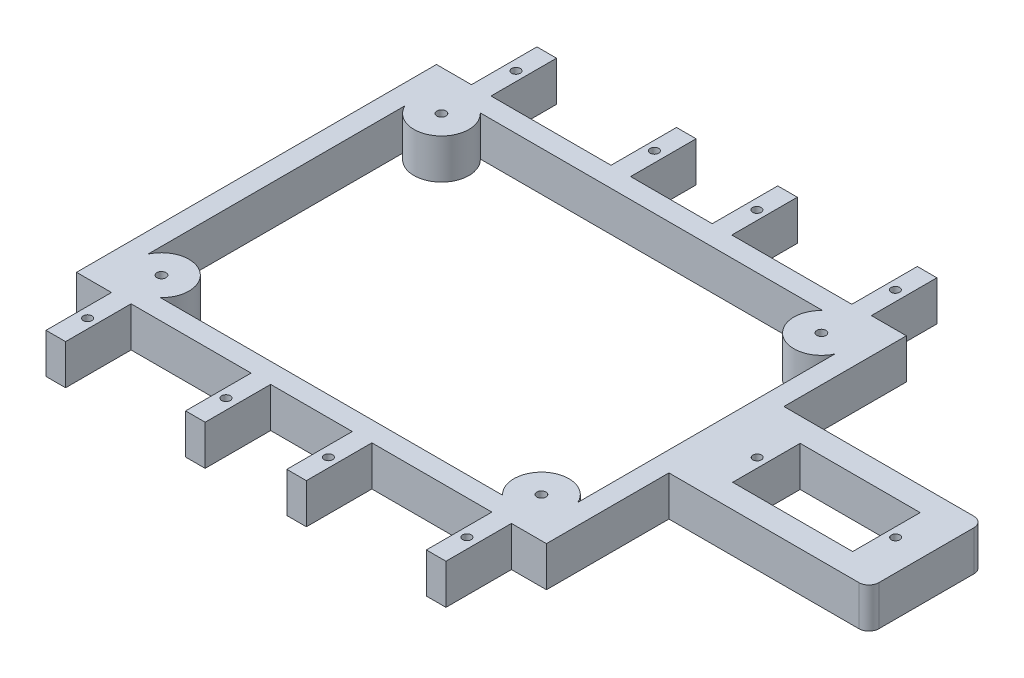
from build123d import *

# Parameters (mm, degrees)
SKETCH_2_W          = 94
SKETCH_2_H          = 72
SKETCH_2_W_2        = 86
SKETCH_2_H_2        = 64
EXTRUDE_1_DEPTH     = 8
SKETCH_3_W          = 3.917685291
SKETCH_3_H          = 13.1
SKETCH_3_R          = 0.85
SKETCH_3_W_2        = 3.91768529
EXTRUDE_2_DEPTH     = 8
FILLET_1_R          = 5
SKETCH_4_R          = 5.5
SKETCH_4_R_2        = 0.9
EXTRUDE_3_DEPTH     = 8
SKETCH_5_W          = 23
SKETCH_5_H          = 8
EXTRUDE_4_DEPTH     = 40
SKETCH_6_W          = 24
SKETCH_6_H          = 13.5
CUT_EXTRUDE_1_DEPTH = 101.21881061
CUT_EXTRUDE_2_REACH = 102.219
SKETCH_7_R          = 0.85
FILLET_2_R          = 2


with BuildPart() as part:
    # Sketch 2 → Extrude 1 (new body)
    with BuildSketch(Plane(origin=(0, 0, 0), x_dir=(1, 0, 0), z_dir=(0, 1, 0))):
        Rectangle(SKETCH_2_W, SKETCH_2_H)
        Rectangle(SKETCH_2_W_2, SKETCH_2_H_2, mode=Mode.SUBTRACT)
    extrude(amount=EXTRUDE_1_DEPTH)

    # Sketch 3 → Extrude 2 (add)
    # profile 1 of 8: a face of its own
    with BuildSketch(Plane(origin=(0, 8, 0), x_dir=(1, 0, 0), z_dir=(0, 1, 0))):
        with Locations((38.041157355, -42.55)):
            Rectangle(SKETCH_3_W, SKETCH_3_H)
        with Locations(Location((37.943067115, -42.85, 0), (0, 0, 270))):
            Circle(SKETCH_3_R, mode=Mode.SUBTRACT)
    # profile 2 of 8: a face of its own
    with BuildSketch(Plane(origin=(0, 8, 0), x_dir=(1, 0, 0), z_dir=(0, 1, 0))):
        with Locations((10.123472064, -42.55)):
            Rectangle(SKETCH_3_W_2, SKETCH_3_H)
        with Locations(Location((10.243067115, -42.85, 0), (0, 0, 270))):
            Circle(SKETCH_3_R, mode=Mode.SUBTRACT)
    # profile 3 of 8: a face of its own
    with BuildSketch(Plane(origin=(0, 8, 0), x_dir=(1, 0, 0), z_dir=(0, 1, 0))):
        with Locations((-38.041157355, -42.55)):
            Rectangle(SKETCH_3_W, SKETCH_3_H)
        with Locations(Location((-37.943067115, -42.85, 0), (0, 0, 90))):
            Circle(SKETCH_3_R, mode=Mode.SUBTRACT)
    # profile 4 of 8: a face of its own
    with BuildSketch(Plane(origin=(0, 8, 0), x_dir=(1, 0, 0), z_dir=(0, 1, 0))):
        with Locations((-10.123472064, -42.55)):
            Rectangle(SKETCH_3_W_2, SKETCH_3_H)
        with Locations(Location((-10.243067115, -42.85, 0), (0, 0, 90))):
            Circle(SKETCH_3_R, mode=Mode.SUBTRACT)
    # profile 5 of 8: a face of its own
    with BuildSketch(Plane(origin=(0, 8, 0), x_dir=(1, 0, 0), z_dir=(0, 1, 0))):
        with Locations((-10.123472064, 42.55)):
            Rectangle(SKETCH_3_W_2, SKETCH_3_H)
        with Locations(Location((-10.243067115, 42.85, 0), (0, 0, 270))):
            Circle(SKETCH_3_R, mode=Mode.SUBTRACT)
    # profile 6 of 8: a face of its own
    with BuildSketch(Plane(origin=(0, 8, 0), x_dir=(1, 0, 0), z_dir=(0, 1, 0))):
        with Locations((-38.041157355, 42.55)):
            Rectangle(SKETCH_3_W, SKETCH_3_H)
        with Locations(Location((-37.943067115, 42.85, 0), (0, 0, 270))):
            Circle(SKETCH_3_R, mode=Mode.SUBTRACT)
    # profile 7 of 8: a face of its own
    with BuildSketch(Plane(origin=(0, 8, 0), x_dir=(1, 0, 0), z_dir=(0, 1, 0))):
        with Locations((38.041157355, 42.55)):
            Rectangle(SKETCH_3_W, SKETCH_3_H)
        with Locations(Location((37.943067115, 42.85, 0), (0, 0, 90))):
            Circle(SKETCH_3_R, mode=Mode.SUBTRACT)
    # profile 8 of 8: a face of its own
    with BuildSketch(Plane(origin=(0, 8, 0), x_dir=(1, 0, 0), z_dir=(0, 1, 0))):
        with Locations((10.123472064, 42.55)):
            Rectangle(SKETCH_3_W_2, SKETCH_3_H)
        with Locations(Location((10.243067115, 42.85, 0), (0, 0, 90))):
            Circle(SKETCH_3_R, mode=Mode.SUBTRACT)
    extrude(amount=-EXTRUDE_2_DEPTH)

    # Fillet 1
    fillet_1_edges = [part.edges().sort_by_distance(p)[0] for p in [
        (43, 4, 32),
        (43, 4, -32),
        (-43, 4, -32),
        (-43, 4, 32),
    ]]
    fillet(fillet_1_edges, radius=FILLET_1_R)

    # Sketch 4 → Extrude 3 (add)
    # profile 1 of 4: a face of its own
    with BuildSketch(Plane.XZ):
        with Locations((-38, 28)):
            Circle(SKETCH_4_R)
        with Locations(Location((-38, 28, 0), (0, 0, 270))):
            Circle(SKETCH_4_R_2, mode=Mode.SUBTRACT)
    # profile 2 of 4: a face of its own
    with BuildSketch(Plane.XZ):
        with Locations((38, 28)):
            Circle(SKETCH_4_R)
        with Locations(Location((38, 28, 0), (0, 0, 270))):
            Circle(SKETCH_4_R_2, mode=Mode.SUBTRACT)
    # profile 3 of 4: a face of its own
    with BuildSketch(Plane.XZ):
        with Locations((-38, -28)):
            Circle(SKETCH_4_R)
        with Locations(Location((-38, -28, 0), (0, 0, 270))):
            Circle(SKETCH_4_R_2, mode=Mode.SUBTRACT)
    # profile 4 of 4: a face of its own
    with BuildSketch(Plane.XZ):
        with Locations((38, -28)):
            Circle(SKETCH_4_R)
        with Locations(Location((38, -28, 0), (0, 0, 270))):
            Circle(SKETCH_4_R_2, mode=Mode.SUBTRACT)
    extrude(amount=-EXTRUDE_3_DEPTH)

    # Sketch 5 → Extrude 4 (add)
    with BuildSketch(Plane(origin=(47, 0, 0), x_dir=(0, 0, -1), z_dir=(1, 0, 0))):
        with Locations((0, 4)):
            Rectangle(SKETCH_5_W, SKETCH_5_H)
    extrude(amount=EXTRUDE_4_DEPTH)

    # Sketch 6 → Cut-Extrude 1 (cut, through all)
    with BuildSketch(Plane(origin=(0, 8, 0), x_dir=(1, 0, 0), z_dir=(0, 1, 0))):
        with Locations((67, 0)):
            Rectangle(SKETCH_6_W, SKETCH_6_H)
    extrude(amount=-CUT_EXTRUDE_1_DEPTH, mode=Mode.SUBTRACT)

    # Sketch 7 → Cut-Extrude 2 (cut, up to next)
    with BuildSketch(Plane(origin=(0, 8, 0), x_dir=(1, 0, 0), z_dir=(0, 1, 0)), mode=Mode.PRIVATE) as cut_extrude_2_sk1:
        with Locations(Location((80.85, 0, 0), (0, 0, 270))):
            Circle(SKETCH_7_R)
    cut_extrude_2_tool1 = extrude(cut_extrude_2_sk1.sketch, amount=-CUT_EXTRUDE_2_REACH, mode=Mode.PRIVATE) & part.part
    # Sketch 7 → Cut-Extrude 2 (cut, up to next)
    with BuildSketch(Plane(origin=(0, 8, 0), x_dir=(1, 0, 0), z_dir=(0, 1, 0)), mode=Mode.PRIVATE) as cut_extrude_2_sk2:
        with Locations(Location((53.15, 0, 0), (0, 0, 270))):
            Circle(SKETCH_7_R)
    cut_extrude_2_tool2 = extrude(cut_extrude_2_sk2.sketch, amount=-CUT_EXTRUDE_2_REACH, mode=Mode.PRIVATE) & part.part
    add(cut_extrude_2_tool1.solids().sort_by_distance((80.85, 8, 0))[0], mode=Mode.SUBTRACT)
    add(cut_extrude_2_tool2.solids().sort_by_distance((53.15, 8, 0))[0], mode=Mode.SUBTRACT)

    # Fillet 2
    fillet_2_edges = [part.edges().sort_by_distance(p)[0] for p in [
        (87, 4, 11.5),
        (87, 4, -11.5),
    ]]
    fillet(fillet_2_edges, radius=FILLET_2_R)


solid = part.part
